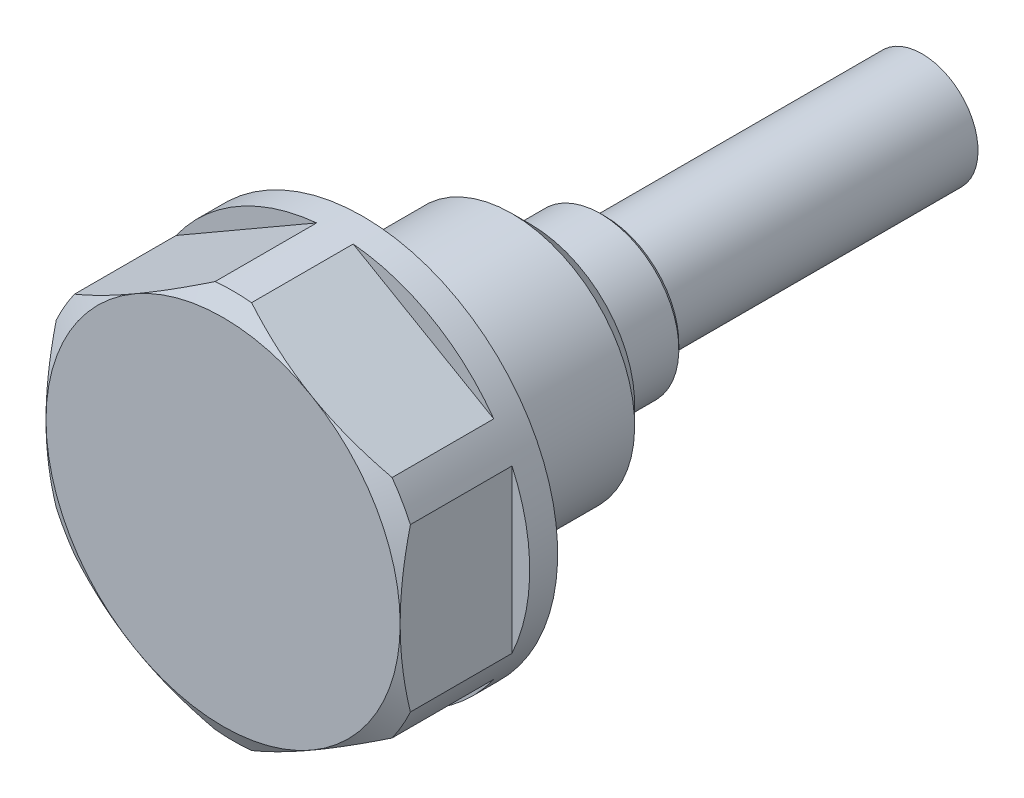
ISO-10303-21;
HEADER;
FILE_DESCRIPTION(('STEP AP214'),'2;1');
FILE_NAME('part.step','',(''),(''),'','','');
FILE_SCHEMA(('AUTOMOTIVE_DESIGN { 1 0 10303 214 1 1 1 1 }'));
ENDSEC;
DATA;
#1=APPLICATION_CONTEXT('core data for automotive mechanical design processes');
#2=APPLICATION_PROTOCOL_DEFINITION('international standard','automotive_design',2000,#1);
#3=PRODUCT_CONTEXT('',#1,'mechanical');
#4=PRODUCT('Part','Part','',(#3));
#5=PRODUCT_RELATED_PRODUCT_CATEGORY('part','',(#4));
#6=PRODUCT_DEFINITION_FORMATION('','',#4);
#7=PRODUCT_DEFINITION_CONTEXT('part definition',#1,'design');
#8=PRODUCT_DEFINITION('design','',#6,#7);
#9=PRODUCT_DEFINITION_SHAPE('','',#8);
#10=(LENGTH_UNIT() NAMED_UNIT(*) SI_UNIT(.MILLI.,.METRE.));
#11=(NAMED_UNIT(*) PLANE_ANGLE_UNIT() SI_UNIT($,.RADIAN.));
#12=(NAMED_UNIT(*) SI_UNIT($,.STERADIAN.) SOLID_ANGLE_UNIT());
#13=UNCERTAINTY_MEASURE_WITH_UNIT(LENGTH_MEASURE(1.E-05),#10,'distance_accuracy_value','');
#14=(GEOMETRIC_REPRESENTATION_CONTEXT(3) GLOBAL_UNCERTAINTY_ASSIGNED_CONTEXT((#13)) GLOBAL_UNIT_ASSIGNED_CONTEXT((#10,
#11,#12)) REPRESENTATION_CONTEXT('',''));
#15=CARTESIAN_POINT('',(0.,0.,0.));
#16=DIRECTION('',(0.,0.,1.));
#17=DIRECTION('',(1.,0.,0.));
#18=AXIS2_PLACEMENT_3D('',#15,#16,#17);
#19=CARTESIAN_POINT('',(0.,0.,8.));
#20=DIRECTION('',(0.,0.,-1.));
#21=DIRECTION('',(0.,1.,0.));
#22=AXIS2_PLACEMENT_3D('',#19,#20,#21);
#23=CONICAL_SURFACE('',#22,9.5,1.0471975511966);
#24=CARTESIAN_POINT('',(0.,0.,7.45151724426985));
#25=DIRECTION('',(0.,0.,-1.));
#26=DIRECTION('',(0.,1.,0.));
#27=AXIS2_PLACEMENT_3D('',#24,#25,#26);
#28=CIRCLE('',#27,10.45);
#29=CARTESIAN_POINT('',(0.979804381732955,-10.4039647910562,7.45151724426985));
#30=VERTEX_POINT('',#29);
#31=CARTESIAN_POINT('',(-0.979804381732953,-10.4039647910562,7.45151724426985));
#32=VERTEX_POINT('',#31);
#33=EDGE_CURVE('E188',#30,#32,#28,.T.);
#34=ORIENTED_EDGE('',*,*,#33,.F.);
#35=CARTESIAN_POINT('',(0.979084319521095,-10.404380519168,7.45131724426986));
#36=CARTESIAN_POINT('',(1.18035340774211,-10.2881777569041,7.50723052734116));
#37=CARTESIAN_POINT('',(1.38237568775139,-10.1715401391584,7.5596440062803));
#38=CARTESIAN_POINT('',(1.78787427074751,-9.9374254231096,7.65669979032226));
#39=CARTESIAN_POINT('',(1.99135098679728,-9.81994808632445,7.70133978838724));
#40=CARTESIAN_POINT('',(2.39982016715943,-9.58411829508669,7.78208913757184));
#41=CARTESIAN_POINT('',(2.60481409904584,-9.46576499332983,7.81818867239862));
#42=CARTESIAN_POINT('',(3.01585684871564,-9.22844935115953,7.88106875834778));
#43=CARTESIAN_POINT('',(3.22190555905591,-9.1094870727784,7.90785024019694));
#44=CARTESIAN_POINT('',(3.63076754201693,-8.87343049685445,7.95108285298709));
#45=CARTESIAN_POINT('',(3.83356555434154,-8.75634500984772,7.96772524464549));
#46=CARTESIAN_POINT('',(4.23958832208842,-8.52192765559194,7.99110913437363));
#47=CARTESIAN_POINT('',(4.4428130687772,-8.40459579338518,7.99785083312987));
#48=CARTESIAN_POINT('',(4.84917698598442,-8.16998147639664,8.00127268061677));
#49=CARTESIAN_POINT('',(5.05231610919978,-8.05269904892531,7.99796024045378));
#50=CARTESIAN_POINT('',(5.45827120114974,-7.8183207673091,7.98137010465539));
#51=CARTESIAN_POINT('',(5.66108719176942,-7.70122490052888,7.96809311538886));
#52=CARTESIAN_POINT('',(6.08626864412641,-7.45574627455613,7.9300729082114));
#53=CARTESIAN_POINT('',(6.30856621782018,-7.32740271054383,7.90431807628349));
#54=CARTESIAN_POINT('',(6.75200827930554,-7.07138131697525,7.84179648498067));
#55=CARTESIAN_POINT('',(6.9731526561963,-6.9437035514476,7.80502868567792));
#56=CARTESIAN_POINT('',(7.41643130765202,-6.68777650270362,7.72088916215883));
#57=CARTESIAN_POINT('',(7.63854931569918,-6.55953661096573,7.67340424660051));
#58=CARTESIAN_POINT('',(8.08105043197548,-6.3040584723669,7.56910437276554));
#59=CARTESIAN_POINT('',(8.30143418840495,-6.17681985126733,7.51229309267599));
#60=CARTESIAN_POINT('',(8.5209156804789,-6.05010215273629,7.45131724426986));
#61=B_SPLINE_CURVE_WITH_KNOTS('',3,(#35,#36,#37,#38,#39,#40,#41,#42,#43,#44,#45,#46,#47,#48,#49,
#50,#51,#52,#53,#54,#55,#56,#57,#58,#59,#60),.UNSPECIFIED.,.F.,.F.,(4,2,2,2,2,2,2,2,2,2,2,2,4),
(0.,0.717123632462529,1.43445973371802,2.15261636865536,2.87070125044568,3.57478328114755,
4.27885103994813,4.98239994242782,5.68589897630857,6.45956921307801,7.23331252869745,
8.01564581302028,8.79767129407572),.UNSPECIFIED.);
#62=CARTESIAN_POINT('',(4.75,-8.22724133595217,8.));
#63=VERTEX_POINT('',#62);
#64=EDGE_CURVE('E291',#30,#63,#61,.T.);
#65=ORIENTED_EDGE('',*,*,#64,.T.);
#66=CARTESIAN_POINT('',(0.,0.,8.));
#67=DIRECTION('',(0.,0.,-1.));
#68=DIRECTION('',(0.,1.,0.));
#69=AXIS2_PLACEMENT_3D('',#66,#67,#68);
#70=CIRCLE('',#69,9.5);
#71=CARTESIAN_POINT('',(-4.75,-8.22724133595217,8.));
#72=VERTEX_POINT('',#71);
#73=EDGE_CURVE('E170',#63,#72,#70,.T.);
#74=ORIENTED_EDGE('',*,*,#73,.T.);
#75=CARTESIAN_POINT('',(-8.5209156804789,-6.05010215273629,7.45131724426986));
#76=CARTESIAN_POINT('',(-8.31964659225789,-6.16630491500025,7.50723052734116));
#77=CARTESIAN_POINT('',(-8.11762431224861,-6.28294253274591,7.5596440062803));
#78=CARTESIAN_POINT('',(-7.71212572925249,-6.51705724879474,7.65669979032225));
#79=CARTESIAN_POINT('',(-7.50864901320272,-6.63453458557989,7.70133978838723));
#80=CARTESIAN_POINT('',(-7.10017983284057,-6.87036437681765,7.78208913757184));
#81=CARTESIAN_POINT('',(-6.89518590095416,-6.9887176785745,7.81818867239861));
#82=CARTESIAN_POINT('',(-6.48414315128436,-7.22603332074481,7.88106875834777));
#83=CARTESIAN_POINT('',(-6.27809444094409,-7.34499559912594,7.90785024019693));
#84=CARTESIAN_POINT('',(-5.86923245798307,-7.58105217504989,7.95108285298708));
#85=CARTESIAN_POINT('',(-5.66643444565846,-7.69813766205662,7.96772524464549));
#86=CARTESIAN_POINT('',(-5.26041167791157,-7.9325550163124,7.99110913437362));
#87=CARTESIAN_POINT('',(-5.0571869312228,-8.04988687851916,7.99785083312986));
#88=CARTESIAN_POINT('',(-4.65082301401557,-8.2845011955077,8.00127268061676));
#89=CARTESIAN_POINT('',(-4.44768389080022,-8.40178362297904,7.99796024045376));
#90=CARTESIAN_POINT('',(-4.04172879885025,-8.63616190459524,7.98137010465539));
#91=CARTESIAN_POINT('',(-3.83891280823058,-8.75325777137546,7.96809311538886));
#92=CARTESIAN_POINT('',(-3.41373135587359,-8.99873639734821,7.9300729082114));
#93=CARTESIAN_POINT('',(-3.19143378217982,-9.12707996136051,7.90431807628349));
#94=CARTESIAN_POINT('',(-2.74799172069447,-9.38310135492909,7.84179648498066));
#95=CARTESIAN_POINT('',(-2.5268473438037,-9.51077912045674,7.80502868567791));
#96=CARTESIAN_POINT('',(-2.08356869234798,-9.76670616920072,7.72088916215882));
#97=CARTESIAN_POINT('',(-1.86145068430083,-9.89494606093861,7.6734042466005));
#98=CARTESIAN_POINT('',(-1.41894956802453,-10.1504241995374,7.56910437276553));
#99=CARTESIAN_POINT('',(-1.19856581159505,-10.277662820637,7.51229309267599));
#100=CARTESIAN_POINT('',(-0.979084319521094,-10.404380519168,7.45131724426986));
#101=B_SPLINE_CURVE_WITH_KNOTS('',3,(#75,#76,#77,#78,#79,#80,#81,#82,#83,#84,#85,#86,#87,#88,
#89,#90,#91,#92,#93,#94,#95,#96,#97,#98,#99,#100),.UNSPECIFIED.,.F.,.F.,(4,2,2,2,2,2,2,2,2,2,2,
2,4),(0.,0.717123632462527,1.43445973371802,2.15261636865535,2.87070125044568,3.57478328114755,
4.27885103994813,4.98239994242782,5.68589897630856,6.459569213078,7.23331252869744,
8.01564581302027,8.79767129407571),.UNSPECIFIED.);
#102=EDGE_CURVE('E193',#72,#32,#101,.T.);
#103=ORIENTED_EDGE('',*,*,#102,.T.);
#104=EDGE_LOOP('',(#34,#65,#74,#103));
#105=FACE_BOUND('',#104,.T.);
#106=ADVANCED_FACE('F14',(#105),#23,.T.);
#107=CARTESIAN_POINT('',(4.75,8.22724133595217,8.));
#108=VERTEX_POINT('',#107);
#109=CARTESIAN_POINT('',(9.5,0.,8.));
#110=VERTEX_POINT('',#109);
#111=EDGE_CURVE('E171',#108,#110,#70,.T.);
#112=ORIENTED_EDGE('',*,*,#111,.T.);
#113=CARTESIAN_POINT('',(9.5,14.5049986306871,3.47408357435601));
#114=CARTESIAN_POINT('',(9.5,14.2966155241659,3.57472653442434));
#115=CARTESIAN_POINT('',(9.5,14.0879793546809,3.67484526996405));
#116=CARTESIAN_POINT('',(9.5,13.6701474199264,3.87391386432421));
#117=CARTESIAN_POINT('',(9.5,13.4609516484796,3.97286371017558));
#118=CARTESIAN_POINT('',(9.5,12.8323827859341,4.26780825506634));
#119=CARTESIAN_POINT('',(9.5,12.4120966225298,4.46186479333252));
#120=CARTESIAN_POINT('',(9.5,11.566179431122,4.84466753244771));
#121=CARTESIAN_POINT('',(9.5,11.1405315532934,5.03337659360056));
#122=CARTESIAN_POINT('',(9.5,10.2857226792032,5.40263231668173));
#123=CARTESIAN_POINT('',(9.5,9.85656186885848,5.58317940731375));
#124=CARTESIAN_POINT('',(9.5,8.98890973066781,5.93599798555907));
#125=CARTESIAN_POINT('',(9.5,8.55036807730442,6.10814639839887));
#126=CARTESIAN_POINT('',(9.5,7.6680986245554,6.43885683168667));
#127=CARTESIAN_POINT('',(9.5,7.2243702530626,6.59741733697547));
#128=CARTESIAN_POINT('',(9.5,6.33194121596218,6.89666011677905));
#129=CARTESIAN_POINT('',(9.5,5.88325356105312,7.03738076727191));
#130=CARTESIAN_POINT('',(9.5,4.97951775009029,7.29634936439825));
#131=CARTESIAN_POINT('',(9.5,4.5244716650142,7.41460445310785));
#132=CARTESIAN_POINT('',(9.5,3.60761543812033,7.6228695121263));
#133=CARTESIAN_POINT('',(9.5,3.1458030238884,7.71286975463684));
#134=CARTESIAN_POINT('',(9.5,2.44905660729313,7.82214872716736));
#135=CARTESIAN_POINT('',(9.5,2.21610795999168,7.85429049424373));
#136=CARTESIAN_POINT('',(9.5,1.74913216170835,7.90936727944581));
#137=CARTESIAN_POINT('',(9.5,1.51510511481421,7.9323031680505));
#138=CARTESIAN_POINT('',(9.5,1.04775047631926,7.96835279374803));
#139=CARTESIAN_POINT('',(9.5,0.814427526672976,7.98152647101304));
#140=CARTESIAN_POINT('',(9.5,0.347433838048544,7.99798272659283));
#141=CARTESIAN_POINT('',(9.5,0.113763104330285,8.00126545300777));
#142=CARTESIAN_POINT('',(9.5,-0.353441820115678,7.99786178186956));
#143=CARTESIAN_POINT('',(9.5,-0.586976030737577,7.99117814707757));
#144=CARTESIAN_POINT('',(9.5,-1.05356083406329,7.9680067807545));
#145=CARTESIAN_POINT('',(9.5,-1.28661139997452,7.95151851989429));
#146=CARTESIAN_POINT('',(9.5,-1.85262325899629,7.89990889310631));
#147=CARTESIAN_POINT('',(9.5,-2.18513944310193,7.8598102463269));
#148=CARTESIAN_POINT('',(9.5,-2.84753886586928,7.7618957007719));
#149=CARTESIAN_POINT('',(9.5,-3.17742170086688,7.70407713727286));
#150=CARTESIAN_POINT('',(9.5,-4.16370952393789,7.50694458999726));
#151=CARTESIAN_POINT('',(9.5,-4.81546168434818,7.34408649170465));
#152=CARTESIAN_POINT('',(9.5,-5.79029236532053,7.0636221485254));
#153=CARTESIAN_POINT('',(9.5,-6.11847294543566,6.96274618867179));
#154=CARTESIAN_POINT('',(9.5,-6.77166374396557,6.75102188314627));
#155=CARTESIAN_POINT('',(9.5,-7.09667367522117,6.64017264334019));
#156=CARTESIAN_POINT('',(9.5,-7.74190014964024,6.41087055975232));
#157=CARTESIAN_POINT('',(9.5,-8.06213340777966,6.29246427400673));
#158=CARTESIAN_POINT('',(9.5,-8.69988055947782,6.04884949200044));
#159=CARTESIAN_POINT('',(9.5,-9.01739535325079,5.92364335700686));
#160=CARTESIAN_POINT('',(9.5,-9.33376649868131,5.79567508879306));
#161=B_SPLINE_CURVE_WITH_KNOTS('',3,(#113,#114,#115,#116,#117,#118,#119,#120,#121,#122,#123,
#124,#125,#126,#127,#128,#129,#130,#131,#132,#133,#134,#135,#136,#137,#138,#139,#140,#141,#142,
#143,#144,#145,#146,#147,#148,#149,#150,#151,#152,#153,#154,#155,#156,#157,#158,#159,#160),
.UNSPECIFIED.,.F.,.F.,(4,2,2,2,2,2,2,2,2,2,2,2,2,2,2,2,2,2,2,2,2,2,2,4),(0.,0.694241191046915,
1.38849007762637,2.77721609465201,4.17396211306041,5.57063468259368,6.98381953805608,
8.39716177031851,9.8074101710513,11.2172094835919,12.6274936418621,13.332807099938,
14.0380538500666,14.7389336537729,15.4398029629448,16.140478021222,16.8411909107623,
17.8453952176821,18.84975061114,20.8623409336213,21.8922649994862,22.9222814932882,
23.9464715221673,24.9703081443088),.UNSPECIFIED.);
#162=CARTESIAN_POINT('',(9.5,4.35344691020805,7.45151724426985));
#163=VERTEX_POINT('',#162);
#164=EDGE_CURVE('E278',#110,#163,#161,.F.);
#165=ORIENTED_EDGE('',*,*,#164,.T.);
#166=CARTESIAN_POINT('',(8.52019561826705,6.05051788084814,7.45151724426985));
#167=VERTEX_POINT('',#166);
#168=EDGE_CURVE('E347',#167,#163,#28,.T.);
#169=ORIENTED_EDGE('',*,*,#168,.F.);
#170=CARTESIAN_POINT('',(8.5209156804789,6.05010215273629,7.45131724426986));
#171=CARTESIAN_POINT('',(8.31964659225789,6.16630491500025,7.50723052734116));
#172=CARTESIAN_POINT('',(8.11762431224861,6.28294253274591,7.5596440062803));
#173=CARTESIAN_POINT('',(7.71212572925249,6.51705724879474,7.65669979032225));
#174=CARTESIAN_POINT('',(7.50864901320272,6.63453458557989,7.70133978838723));
#175=CARTESIAN_POINT('',(7.10017983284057,6.87036437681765,7.78208913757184));
#176=CARTESIAN_POINT('',(6.89518590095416,6.9887176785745,7.81818867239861));
#177=CARTESIAN_POINT('',(6.48414315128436,7.22603332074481,7.88106875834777));
#178=CARTESIAN_POINT('',(6.27809444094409,7.34499559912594,7.90785024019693));
#179=CARTESIAN_POINT('',(5.86923245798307,7.58105217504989,7.95108285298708));
#180=CARTESIAN_POINT('',(5.66643444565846,7.69813766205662,7.96772524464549));
#181=CARTESIAN_POINT('',(5.26041167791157,7.9325550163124,7.99110913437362));
#182=CARTESIAN_POINT('',(5.0571869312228,8.04988687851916,7.99785083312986));
#183=CARTESIAN_POINT('',(4.65082301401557,8.2845011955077,8.00127268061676));
#184=CARTESIAN_POINT('',(4.44768389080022,8.40178362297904,7.99796024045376));
#185=CARTESIAN_POINT('',(4.04172879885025,8.63616190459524,7.98137010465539));
#186=CARTESIAN_POINT('',(3.83891280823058,8.75325777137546,7.96809311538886));
#187=CARTESIAN_POINT('',(3.41373135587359,8.99873639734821,7.9300729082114));
#188=CARTESIAN_POINT('',(3.19143378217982,9.12707996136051,7.90431807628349));
#189=CARTESIAN_POINT('',(2.74799172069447,9.38310135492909,7.84179648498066));
#190=CARTESIAN_POINT('',(2.5268473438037,9.51077912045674,7.80502868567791));
#191=CARTESIAN_POINT('',(2.08356869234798,9.76670616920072,7.72088916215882));
#192=CARTESIAN_POINT('',(1.86145068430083,9.89494606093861,7.6734042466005));
#193=CARTESIAN_POINT('',(1.41894956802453,10.1504241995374,7.56910437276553));
#194=CARTESIAN_POINT('',(1.19856581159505,10.277662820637,7.51229309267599));
#195=CARTESIAN_POINT('',(0.979084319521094,10.404380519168,7.45131724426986));
#196=B_SPLINE_CURVE_WITH_KNOTS('',3,(#170,#171,#172,#173,#174,#175,#176,#177,#178,#179,#180,
#181,#182,#183,#184,#185,#186,#187,#188,#189,#190,#191,#192,#193,#194,#195),.UNSPECIFIED.,.F.,
.F.,(4,2,2,2,2,2,2,2,2,2,2,2,4),(0.,0.717123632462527,1.43445973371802,2.15261636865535,
2.87070125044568,3.57478328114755,4.27885103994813,4.98239994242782,5.68589897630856,
6.459569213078,7.23331252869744,8.01564581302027,8.79767129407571),.UNSPECIFIED.);
#197=EDGE_CURVE('E279',#167,#108,#196,.T.);
#198=ORIENTED_EDGE('',*,*,#197,.T.);
#199=EDGE_LOOP('',(#112,#165,#169,#198));
#200=FACE_BOUND('',#199,.T.);
#201=ADVANCED_FACE('F262',(#200),#23,.T.);
#202=CARTESIAN_POINT('',(-4.75,8.22724133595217,8.));
#203=VERTEX_POINT('',#202);
#204=EDGE_CURVE('E283',#203,#108,#70,.T.);
#205=ORIENTED_EDGE('',*,*,#204,.T.);
#206=CARTESIAN_POINT('',(0.979804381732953,10.4039647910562,7.45151724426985));
#207=VERTEX_POINT('',#206);
#208=EDGE_CURVE('E289',#108,#207,#196,.T.);
#209=ORIENTED_EDGE('',*,*,#208,.T.);
#210=CARTESIAN_POINT('',(-0.979804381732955,10.4039647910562,7.45151724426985));
#211=VERTEX_POINT('',#210);
#212=EDGE_CURVE('E346',#211,#207,#28,.T.);
#213=ORIENTED_EDGE('',*,*,#212,.F.);
#214=CARTESIAN_POINT('',(-0.979084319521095,10.404380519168,7.45131724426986));
#215=CARTESIAN_POINT('',(-1.18035340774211,10.2881777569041,7.50723052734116));
#216=CARTESIAN_POINT('',(-1.38237568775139,10.1715401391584,7.5596440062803));
#217=CARTESIAN_POINT('',(-1.78787427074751,9.9374254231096,7.65669979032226));
#218=CARTESIAN_POINT('',(-1.99135098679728,9.81994808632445,7.70133978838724));
#219=CARTESIAN_POINT('',(-2.39982016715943,9.58411829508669,7.78208913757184));
#220=CARTESIAN_POINT('',(-2.60481409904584,9.46576499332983,7.81818867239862));
#221=CARTESIAN_POINT('',(-3.01585684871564,9.22844935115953,7.88106875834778));
#222=CARTESIAN_POINT('',(-3.22190555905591,9.1094870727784,7.90785024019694));
#223=CARTESIAN_POINT('',(-3.63076754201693,8.87343049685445,7.95108285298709));
#224=CARTESIAN_POINT('',(-3.83356555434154,8.75634500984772,7.96772524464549));
#225=CARTESIAN_POINT('',(-4.23958832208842,8.52192765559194,7.99110913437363));
#226=CARTESIAN_POINT('',(-4.4428130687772,8.40459579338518,7.99785083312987));
#227=CARTESIAN_POINT('',(-4.84917698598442,8.16998147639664,8.00127268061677));
#228=CARTESIAN_POINT('',(-5.05231610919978,8.05269904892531,7.99796024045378));
#229=CARTESIAN_POINT('',(-5.45827120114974,7.8183207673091,7.98137010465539));
#230=CARTESIAN_POINT('',(-5.66108719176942,7.70122490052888,7.96809311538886));
#231=CARTESIAN_POINT('',(-6.08626864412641,7.45574627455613,7.9300729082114));
#232=CARTESIAN_POINT('',(-6.30856621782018,7.32740271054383,7.90431807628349));
#233=CARTESIAN_POINT('',(-6.75200827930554,7.07138131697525,7.84179648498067));
#234=CARTESIAN_POINT('',(-6.9731526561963,6.9437035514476,7.80502868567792));
#235=CARTESIAN_POINT('',(-7.41643130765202,6.68777650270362,7.72088916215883));
#236=CARTESIAN_POINT('',(-7.63854931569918,6.55953661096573,7.67340424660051));
#237=CARTESIAN_POINT('',(-8.08105043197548,6.3040584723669,7.56910437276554));
#238=CARTESIAN_POINT('',(-8.30143418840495,6.17681985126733,7.51229309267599));
#239=CARTESIAN_POINT('',(-8.5209156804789,6.05010215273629,7.45131724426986));
#240=B_SPLINE_CURVE_WITH_KNOTS('',3,(#214,#215,#216,#217,#218,#219,#220,#221,#222,#223,#224,
#225,#226,#227,#228,#229,#230,#231,#232,#233,#234,#235,#236,#237,#238,#239),.UNSPECIFIED.,.F.,
.F.,(4,2,2,2,2,2,2,2,2,2,2,2,4),(0.,0.717123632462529,1.43445973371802,2.15261636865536,
2.87070125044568,3.57478328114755,4.27885103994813,4.98239994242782,5.68589897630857,
6.45956921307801,7.23331252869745,8.01564581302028,8.79767129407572),.UNSPECIFIED.);
#241=EDGE_CURVE('E327',#211,#203,#240,.T.);
#242=ORIENTED_EDGE('',*,*,#241,.T.);
#243=EDGE_LOOP('',(#205,#209,#213,#242));
#244=FACE_BOUND('',#243,.T.);
#245=ADVANCED_FACE('F266',(#244),#23,.T.);
#246=CARTESIAN_POINT('',(-9.5,0.,8.));
#247=VERTEX_POINT('',#246);
#248=EDGE_CURVE('E459',#247,#203,#70,.T.);
#249=ORIENTED_EDGE('',*,*,#248,.T.);
#250=CARTESIAN_POINT('',(-8.52019561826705,6.05051788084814,7.45151724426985));
#251=VERTEX_POINT('',#250);
#252=EDGE_CURVE('E333',#203,#251,#240,.T.);
#253=ORIENTED_EDGE('',*,*,#252,.T.);
#254=CARTESIAN_POINT('',(-9.5,4.35344691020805,7.45151724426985));
#255=VERTEX_POINT('',#254);
#256=EDGE_CURVE('E343',#255,#251,#28,.T.);
#257=ORIENTED_EDGE('',*,*,#256,.F.);
#258=CARTESIAN_POINT('',(-9.5,14.5049986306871,3.474083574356));
#259=CARTESIAN_POINT('',(-9.5,14.2966155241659,3.57472653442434));
#260=CARTESIAN_POINT('',(-9.5,14.0879793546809,3.67484526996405));
#261=CARTESIAN_POINT('',(-9.5,13.6701474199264,3.87391386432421));
#262=CARTESIAN_POINT('',(-9.5,13.4609516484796,3.97286371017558));
#263=CARTESIAN_POINT('',(-9.5,12.8323827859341,4.26780825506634));
#264=CARTESIAN_POINT('',(-9.5,12.4120966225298,4.46186479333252));
#265=CARTESIAN_POINT('',(-9.5,11.566179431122,4.84466753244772));
#266=CARTESIAN_POINT('',(-9.5,11.1405315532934,5.03337659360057));
#267=CARTESIAN_POINT('',(-9.5,10.2857226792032,5.40263231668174));
#268=CARTESIAN_POINT('',(-9.5,9.85656186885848,5.58317940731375));
#269=CARTESIAN_POINT('',(-9.5,8.98890973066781,5.93599798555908));
#270=CARTESIAN_POINT('',(-9.5,8.55036807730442,6.10814639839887));
#271=CARTESIAN_POINT('',(-9.5,7.6680986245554,6.43885683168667));
#272=CARTESIAN_POINT('',(-9.5,7.2243702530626,6.59741733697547));
#273=CARTESIAN_POINT('',(-9.5,6.33194121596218,6.89666011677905));
#274=CARTESIAN_POINT('',(-9.5,5.88325356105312,7.03738076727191));
#275=CARTESIAN_POINT('',(-9.5,4.97951775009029,7.29634936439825));
#276=CARTESIAN_POINT('',(-9.5,4.5244716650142,7.41460445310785));
#277=CARTESIAN_POINT('',(-9.5,3.60761543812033,7.6228695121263));
#278=CARTESIAN_POINT('',(-9.5,3.1458030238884,7.71286975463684));
#279=CARTESIAN_POINT('',(-9.5,2.44905660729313,7.82214872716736));
#280=CARTESIAN_POINT('',(-9.5,2.21610795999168,7.85429049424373));
#281=CARTESIAN_POINT('',(-9.5,1.74913216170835,7.90936727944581));
#282=CARTESIAN_POINT('',(-9.5,1.51510511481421,7.9323031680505));
#283=CARTESIAN_POINT('',(-9.5,1.04775047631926,7.96835279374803));
#284=CARTESIAN_POINT('',(-9.5,0.814427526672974,7.98152647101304));
#285=CARTESIAN_POINT('',(-9.5,0.347433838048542,7.99798272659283));
#286=CARTESIAN_POINT('',(-9.5,0.113763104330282,8.00126545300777));
#287=CARTESIAN_POINT('',(-9.5,-0.353441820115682,7.99786178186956));
#288=CARTESIAN_POINT('',(-9.5,-0.586976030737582,7.99117814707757));
#289=CARTESIAN_POINT('',(-9.5,-1.0535608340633,7.9680067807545));
#290=CARTESIAN_POINT('',(-9.5,-1.28661139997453,7.95151851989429));
#291=CARTESIAN_POINT('',(-9.5,-1.8526232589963,7.89990889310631));
#292=CARTESIAN_POINT('',(-9.5,-2.18513944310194,7.8598102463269));
#293=CARTESIAN_POINT('',(-9.5,-2.84753886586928,7.7618957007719));
#294=CARTESIAN_POINT('',(-9.5,-3.17742170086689,7.70407713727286));
#295=CARTESIAN_POINT('',(-9.5,-4.1637095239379,7.50694458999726));
#296=CARTESIAN_POINT('',(-9.5,-4.81546168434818,7.34408649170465));
#297=CARTESIAN_POINT('',(-9.5,-5.79029236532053,7.0636221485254));
#298=CARTESIAN_POINT('',(-9.5,-6.11847294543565,6.96274618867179));
#299=CARTESIAN_POINT('',(-9.5,-6.77166374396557,6.75102188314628));
#300=CARTESIAN_POINT('',(-9.5,-7.09667367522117,6.64017264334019));
#301=CARTESIAN_POINT('',(-9.5,-7.74190014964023,6.41087055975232));
#302=CARTESIAN_POINT('',(-9.5,-8.06213340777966,6.29246427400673));
#303=CARTESIAN_POINT('',(-9.5,-8.69988055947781,6.04884949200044));
#304=CARTESIAN_POINT('',(-9.5,-9.01739535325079,5.92364335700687));
#305=CARTESIAN_POINT('',(-9.5,-9.3337664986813,5.79567508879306));
#306=B_SPLINE_CURVE_WITH_KNOTS('',3,(#258,#259,#260,#261,#262,#263,#264,#265,#266,#267,#268,
#269,#270,#271,#272,#273,#274,#275,#276,#277,#278,#279,#280,#281,#282,#283,#284,#285,#286,#287,
#288,#289,#290,#291,#292,#293,#294,#295,#296,#297,#298,#299,#300,#301,#302,#303,#304,#305),
.UNSPECIFIED.,.F.,.F.,(4,2,2,2,2,2,2,2,2,2,2,2,2,2,2,2,2,2,2,2,2,2,2,4),(0.,0.694241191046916,
1.38849007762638,2.77721609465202,4.17396211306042,5.57063468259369,6.98381953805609,
8.39716177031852,9.80741017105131,11.2172094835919,12.6274936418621,13.332807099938,
14.0380538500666,14.7389336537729,15.4398029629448,16.140478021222,16.8411909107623,
17.8453952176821,18.84975061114,20.8623409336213,21.8922649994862,22.9222814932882,
23.9464715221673,24.9703081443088),.UNSPECIFIED.);
#307=EDGE_CURVE('E201',#255,#247,#306,.T.);
#308=ORIENTED_EDGE('',*,*,#307,.T.);
#309=EDGE_LOOP('',(#249,#253,#257,#308));
#310=FACE_BOUND('',#309,.T.);
#311=ADVANCED_FACE('F271',(#310),#23,.T.);
#312=EDGE_CURVE('E341',#72,#247,#70,.T.);
#313=ORIENTED_EDGE('',*,*,#312,.T.);
#314=CARTESIAN_POINT('',(-9.5,-4.35344691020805,7.45151724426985));
#315=VERTEX_POINT('',#314);
#316=EDGE_CURVE('E204',#247,#315,#306,.T.);
#317=ORIENTED_EDGE('',*,*,#316,.T.);
#318=CARTESIAN_POINT('',(-8.52019561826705,-6.05051788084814,7.45151724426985));
#319=VERTEX_POINT('',#318);
#320=EDGE_CURVE('E340',#319,#315,#28,.T.);
#321=ORIENTED_EDGE('',*,*,#320,.F.);
#322=EDGE_CURVE('E137',#319,#72,#101,.T.);
#323=ORIENTED_EDGE('',*,*,#322,.T.);
#324=EDGE_LOOP('',(#313,#317,#321,#323));
#325=FACE_BOUND('',#324,.T.);
#326=ADVANCED_FACE('F259',(#325),#23,.T.);
#327=CARTESIAN_POINT('',(0.,0.,8.));
#328=DIRECTION('',(0.,0.,-1.));
#329=DIRECTION('',(0.,1.,0.));
#330=AXIS2_PLACEMENT_3D('',#327,#328,#329);
#331=PLANE('',#330);
#332=EDGE_CURVE('E164',#110,#63,#70,.T.);
#333=ORIENTED_EDGE('',*,*,#332,.F.);
#334=ORIENTED_EDGE('',*,*,#111,.F.);
#335=ORIENTED_EDGE('',*,*,#204,.F.);
#336=ORIENTED_EDGE('',*,*,#248,.F.);
#337=ORIENTED_EDGE('',*,*,#312,.F.);
#338=ORIENTED_EDGE('',*,*,#73,.F.);
#339=EDGE_LOOP('',(#333,#334,#335,#336,#337,#338));
#340=FACE_BOUND('',#339,.T.);
#341=ADVANCED_FACE('F16',(#340),#331,.F.);
#342=ORIENTED_EDGE('',*,*,#332,.T.);
#343=CARTESIAN_POINT('',(8.52019561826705,-6.05051788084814,7.45151724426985));
#344=VERTEX_POINT('',#343);
#345=EDGE_CURVE('E286',#63,#344,#61,.T.);
#346=ORIENTED_EDGE('',*,*,#345,.T.);
#347=CARTESIAN_POINT('',(9.5,-4.35344691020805,7.45151724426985));
#348=VERTEX_POINT('',#347);
#349=EDGE_CURVE('E144',#348,#344,#28,.T.);
#350=ORIENTED_EDGE('',*,*,#349,.F.);
#351=EDGE_CURVE('E287',#348,#110,#161,.F.);
#352=ORIENTED_EDGE('',*,*,#351,.T.);
#353=EDGE_LOOP('',(#342,#346,#350,#352));
#354=FACE_BOUND('',#353,.T.);
#355=ADVANCED_FACE('F218',(#354),#23,.T.);
#356=CARTESIAN_POINT('',(0.,0.,-29.5));
#357=DIRECTION('',(0.,0.,-1.));
#358=DIRECTION('',(0.,1.,0.));
#359=AXIS2_PLACEMENT_3D('',#356,#357,#358);
#360=CYLINDRICAL_SURFACE('',#359,10.45);
#361=CARTESIAN_POINT('',(0.,0.,0.5));
#362=DIRECTION('',(0.,0.,-1.));
#363=DIRECTION('',(0.,1.,0.));
#364=AXIS2_PLACEMENT_3D('',#361,#362,#363);
#365=CIRCLE('',#364,10.45);
#366=CARTESIAN_POINT('',(0.,10.45,0.5));
#367=VERTEX_POINT('',#366);
#368=EDGE_CURVE('E349',#367,#367,#365,.T.);
#369=ORIENTED_EDGE('',*,*,#368,.F.);
#370=EDGE_LOOP('',(#369));
#371=FACE_BOUND('',#370,.T.);
#372=ORIENTED_EDGE('',*,*,#212,.T.);
#373=DIRECTION('',(0.,0.,-1.));
#374=VECTOR('',#373,1.);
#375=CARTESIAN_POINT('',(0.979804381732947,10.4039647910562,-29.5));
#376=LINE('',#375,#374);
#377=CARTESIAN_POINT('',(0.979804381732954,10.4039647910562,2.));
#378=VERTEX_POINT('',#377);
#379=EDGE_CURVE('E9',#207,#378,#376,.T.);
#380=ORIENTED_EDGE('',*,*,#379,.T.);
#381=CARTESIAN_POINT('',(0.,0.,2.));
#382=DIRECTION('',(0.,0.,-1.));
#383=DIRECTION('',(0.,1.,0.));
#384=AXIS2_PLACEMENT_3D('',#381,#382,#383);
#385=CIRCLE('',#384,10.45);
#386=CARTESIAN_POINT('',(8.52019561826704,6.05051788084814,2.));
#387=VERTEX_POINT('',#386);
#388=EDGE_CURVE('E148',#378,#387,#385,.T.);
#389=ORIENTED_EDGE('',*,*,#388,.T.);
#390=DIRECTION('',(0.,0.,-1.));
#391=VECTOR('',#390,1.);
#392=CARTESIAN_POINT('',(8.52019561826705,6.05051788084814,-29.5));
#393=LINE('',#392,#391);
#394=EDGE_CURVE('E22',#387,#167,#393,.F.);
#395=ORIENTED_EDGE('',*,*,#394,.T.);
#396=ORIENTED_EDGE('',*,*,#168,.T.);
#397=DIRECTION('',(0.,0.,-1.));
#398=VECTOR('',#397,1.);
#399=CARTESIAN_POINT('',(9.5,4.35344691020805,-29.5));
#400=LINE('',#399,#398);
#401=CARTESIAN_POINT('',(9.5,4.35344691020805,2.));
#402=VERTEX_POINT('',#401);
#403=EDGE_CURVE('E153',#163,#402,#400,.T.);
#404=ORIENTED_EDGE('',*,*,#403,.T.);
#405=CARTESIAN_POINT('',(9.5,-4.35344691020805,2.));
#406=VERTEX_POINT('',#405);
#407=EDGE_CURVE('E132',#402,#406,#385,.T.);
#408=ORIENTED_EDGE('',*,*,#407,.T.);
#409=DIRECTION('',(0.,0.,-1.));
#410=VECTOR('',#409,1.);
#411=CARTESIAN_POINT('',(9.5,-4.35344691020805,-29.5));
#412=LINE('',#411,#410);
#413=EDGE_CURVE('E147',#406,#348,#412,.F.);
#414=ORIENTED_EDGE('',*,*,#413,.T.);
#415=ORIENTED_EDGE('',*,*,#349,.T.);
#416=DIRECTION('',(0.,0.,-1.));
#417=VECTOR('',#416,1.);
#418=CARTESIAN_POINT('',(8.52019561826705,-6.05051788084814,-29.5));
#419=LINE('',#418,#417);
#420=CARTESIAN_POINT('',(8.52019561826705,-6.05051788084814,2.));
#421=VERTEX_POINT('',#420);
#422=EDGE_CURVE('E135',#344,#421,#419,.T.);
#423=ORIENTED_EDGE('',*,*,#422,.T.);
#424=CARTESIAN_POINT('',(0.97980438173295,-10.4039647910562,2.));
#425=VERTEX_POINT('',#424);
#426=EDGE_CURVE('E120',#421,#425,#385,.T.);
#427=ORIENTED_EDGE('',*,*,#426,.T.);
#428=DIRECTION('',(0.,0.,-1.));
#429=VECTOR('',#428,1.);
#430=CARTESIAN_POINT('',(0.979804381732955,-10.4039647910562,-29.5));
#431=LINE('',#430,#429);
#432=EDGE_CURVE('E128',#425,#30,#431,.F.);
#433=ORIENTED_EDGE('',*,*,#432,.T.);
#434=ORIENTED_EDGE('',*,*,#33,.T.);
#435=DIRECTION('',(0.,0.,-1.));
#436=VECTOR('',#435,1.);
#437=CARTESIAN_POINT('',(-0.979804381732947,-10.4039647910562,-29.5));
#438=LINE('',#437,#436);
#439=CARTESIAN_POINT('',(-0.979804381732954,-10.4039647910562,2.));
#440=VERTEX_POINT('',#439);
#441=EDGE_CURVE('E129',#32,#440,#438,.T.);
#442=ORIENTED_EDGE('',*,*,#441,.T.);
#443=CARTESIAN_POINT('',(-8.52019561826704,-6.05051788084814,2.));
#444=VERTEX_POINT('',#443);
#445=EDGE_CURVE('E131',#440,#444,#385,.T.);
#446=ORIENTED_EDGE('',*,*,#445,.T.);
#447=DIRECTION('',(0.,0.,-1.));
#448=VECTOR('',#447,1.);
#449=CARTESIAN_POINT('',(-8.52019561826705,-6.05051788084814,-29.5));
#450=LINE('',#449,#448);
#451=EDGE_CURVE('E180',#444,#319,#450,.F.);
#452=ORIENTED_EDGE('',*,*,#451,.T.);
#453=ORIENTED_EDGE('',*,*,#320,.T.);
#454=DIRECTION('',(0.,0.,-1.));
#455=VECTOR('',#454,1.);
#456=CARTESIAN_POINT('',(-9.5,-4.35344691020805,-29.5));
#457=LINE('',#456,#455);
#458=CARTESIAN_POINT('',(-9.5,-4.35344691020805,2.));
#459=VERTEX_POINT('',#458);
#460=EDGE_CURVE('E176',#315,#459,#457,.T.);
#461=ORIENTED_EDGE('',*,*,#460,.T.);
#462=CARTESIAN_POINT('',(-9.5,4.35344691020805,2.));
#463=VERTEX_POINT('',#462);
#464=EDGE_CURVE('E165',#459,#463,#385,.T.);
#465=ORIENTED_EDGE('',*,*,#464,.T.);
#466=DIRECTION('',(0.,0.,-1.));
#467=VECTOR('',#466,1.);
#468=CARTESIAN_POINT('',(-9.5,4.35344691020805,-29.5));
#469=LINE('',#468,#467);
#470=EDGE_CURVE('E173',#463,#255,#469,.F.);
#471=ORIENTED_EDGE('',*,*,#470,.T.);
#472=ORIENTED_EDGE('',*,*,#256,.T.);
#473=DIRECTION('',(0.,0.,-1.));
#474=VECTOR('',#473,1.);
#475=CARTESIAN_POINT('',(-8.52019561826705,6.05051788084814,-29.5));
#476=LINE('',#475,#474);
#477=CARTESIAN_POINT('',(-8.52019561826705,6.05051788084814,2.));
#478=VERTEX_POINT('',#477);
#479=EDGE_CURVE('E168',#251,#478,#476,.T.);
#480=ORIENTED_EDGE('',*,*,#479,.T.);
#481=CARTESIAN_POINT('',(-0.97980438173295,10.4039647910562,2.));
#482=VERTEX_POINT('',#481);
#483=EDGE_CURVE('E159',#478,#482,#385,.T.);
#484=ORIENTED_EDGE('',*,*,#483,.T.);
#485=DIRECTION('',(0.,0.,-1.));
#486=VECTOR('',#485,1.);
#487=CARTESIAN_POINT('',(-0.979804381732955,10.4039647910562,-29.5));
#488=LINE('',#487,#486);
#489=EDGE_CURVE('E163',#482,#211,#488,.F.);
#490=ORIENTED_EDGE('',*,*,#489,.T.);
#491=EDGE_LOOP('',(#372,#380,#389,#395,#396,#404,#408,#414,#415,#423,#427,#433,#434,#442,#446,
#452,#453,#461,#465,#471,#472,#480,#484,#490));
#492=FACE_BOUND('',#491,.T.);
#493=ADVANCED_FACE('F141',(#371,#492),#360,.T.);
#494=CARTESIAN_POINT('',(10.45,0.,0.5));
#495=DIRECTION('',(0.,0.,1.));
#496=DIRECTION('',(0.,-1.,0.));
#497=AXIS2_PLACEMENT_3D('',#494,#495,#496);
#498=PLANE('',#497);
#499=CARTESIAN_POINT('',(0.,0.,0.5));
#500=DIRECTION('',(0.,0.,-1.));
#501=DIRECTION('',(0.,1.,0.));
#502=AXIS2_PLACEMENT_3D('',#499,#500,#501);
#503=CIRCLE('',#502,7.21183333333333);
#504=CARTESIAN_POINT('',(0.,7.21183333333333,0.5));
#505=VERTEX_POINT('',#504);
#506=EDGE_CURVE('E352',#505,#505,#503,.T.);
#507=ORIENTED_EDGE('',*,*,#506,.F.);
#508=EDGE_LOOP('',(#507));
#509=FACE_BOUND('',#508,.T.);
#510=ORIENTED_EDGE('',*,*,#368,.T.);
#511=EDGE_LOOP('',(#510));
#512=FACE_BOUND('',#511,.T.);
#513=ADVANCED_FACE('F248',(#509,#512),#498,.F.);
#514=CARTESIAN_POINT('',(0.,0.,-29.5));
#515=DIRECTION('',(0.,0.,-1.));
#516=DIRECTION('',(0.,1.,0.));
#517=AXIS2_PLACEMENT_3D('',#514,#515,#516);
#518=CYLINDRICAL_SURFACE('',#517,7.21183333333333);
#519=CARTESIAN_POINT('',(0.,0.,0.));
#520=DIRECTION('',(0.,0.,-1.));
#521=DIRECTION('',(0.,1.,0.));
#522=AXIS2_PLACEMENT_3D('',#519,#520,#521);
#523=CIRCLE('',#522,7.21183333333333);
#524=CARTESIAN_POINT('',(0.,7.21183333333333,0.));
#525=VERTEX_POINT('',#524);
#526=EDGE_CURVE('E355',#525,#525,#523,.T.);
#527=ORIENTED_EDGE('',*,*,#526,.F.);
#528=EDGE_LOOP('',(#527));
#529=FACE_BOUND('',#528,.T.);
#530=ORIENTED_EDGE('',*,*,#506,.T.);
#531=EDGE_LOOP('',(#530));
#532=FACE_BOUND('',#531,.T.);
#533=ADVANCED_FACE('F244',(#529,#532),#518,.T.);
#534=CARTESIAN_POINT('',(7.21183333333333,0.,0.));
#535=DIRECTION('',(0.,0.,1.));
#536=DIRECTION('',(0.,-1.,0.));
#537=AXIS2_PLACEMENT_3D('',#534,#535,#536);
#538=PLANE('',#537);
#539=CARTESIAN_POINT('',(0.,0.,0.));
#540=DIRECTION('',(0.,0.,-1.));
#541=DIRECTION('',(0.,1.,0.));
#542=AXIS2_PLACEMENT_3D('',#539,#540,#541);
#543=CIRCLE('',#542,6.5785);
#544=CARTESIAN_POINT('',(0.,6.5785,0.));
#545=VERTEX_POINT('',#544);
#546=EDGE_CURVE('E358',#545,#545,#543,.T.);
#547=ORIENTED_EDGE('',*,*,#546,.F.);
#548=EDGE_LOOP('',(#547));
#549=FACE_BOUND('',#548,.T.);
#550=ORIENTED_EDGE('',*,*,#526,.T.);
#551=EDGE_LOOP('',(#550));
#552=FACE_BOUND('',#551,.T.);
#553=ADVANCED_FACE('F240',(#549,#552),#538,.F.);
#554=CARTESIAN_POINT('',(0.,0.,-29.5));
#555=DIRECTION('',(0.,0.,-1.));
#556=DIRECTION('',(0.,1.,0.));
#557=AXIS2_PLACEMENT_3D('',#554,#555,#556);
#558=CYLINDRICAL_SURFACE('',#557,6.5785);
#559=CARTESIAN_POINT('',(0.,0.,0.5));
#560=DIRECTION('',(0.,0.,-1.));
#561=DIRECTION('',(0.,1.,0.));
#562=AXIS2_PLACEMENT_3D('',#559,#560,#561);
#563=CIRCLE('',#562,6.5785);
#564=CARTESIAN_POINT('',(0.,6.5785,0.5));
#565=VERTEX_POINT('',#564);
#566=EDGE_CURVE('E361',#565,#565,#563,.T.);
#567=ORIENTED_EDGE('',*,*,#566,.F.);
#568=EDGE_LOOP('',(#567));
#569=FACE_BOUND('',#568,.T.);
#570=ORIENTED_EDGE('',*,*,#546,.T.);
#571=EDGE_LOOP('',(#570));
#572=FACE_BOUND('',#571,.T.);
#573=ADVANCED_FACE('F236',(#569,#572),#558,.F.);
#574=CARTESIAN_POINT('',(6.5785,0.,0.5));
#575=DIRECTION('',(0.,0.,1.));
#576=DIRECTION('',(0.,-1.,0.));
#577=AXIS2_PLACEMENT_3D('',#574,#575,#576);
#578=PLANE('',#577);
#579=CARTESIAN_POINT('',(0.,0.,0.5));
#580=DIRECTION('',(0.,0.,-1.));
#581=DIRECTION('',(0.,1.,0.));
#582=AXIS2_PLACEMENT_3D('',#579,#580,#581);
#583=CIRCLE('',#582,5.2628);
#584=CARTESIAN_POINT('',(0.,5.2628,0.5));
#585=VERTEX_POINT('',#584);
#586=EDGE_CURVE('E364',#585,#585,#583,.T.);
#587=ORIENTED_EDGE('',*,*,#586,.F.);
#588=EDGE_LOOP('',(#587));
#589=FACE_BOUND('',#588,.T.);
#590=ORIENTED_EDGE('',*,*,#566,.T.);
#591=EDGE_LOOP('',(#590));
#592=FACE_BOUND('',#591,.T.);
#593=ADVANCED_FACE('F232',(#589,#592),#578,.F.);
#594=CARTESIAN_POINT('',(0.,0.,-29.5));
#595=DIRECTION('',(0.,0.,-1.));
#596=DIRECTION('',(0.,1.,0.));
#597=AXIS2_PLACEMENT_3D('',#594,#595,#596);
#598=CYLINDRICAL_SURFACE('',#597,5.2628);
#599=CARTESIAN_POINT('',(0.,0.,-0.5));
#600=DIRECTION('',(0.,0.,-1.));
#601=DIRECTION('',(0.,1.,0.));
#602=AXIS2_PLACEMENT_3D('',#599,#600,#601);
#603=CIRCLE('',#602,5.2628);
#604=CARTESIAN_POINT('',(0.,5.2628,-0.5));
#605=VERTEX_POINT('',#604);
#606=EDGE_CURVE('E366',#605,#605,#603,.T.);
#607=ORIENTED_EDGE('',*,*,#606,.F.);
#608=EDGE_LOOP('',(#607));
#609=FACE_BOUND('',#608,.T.);
#610=ORIENTED_EDGE('',*,*,#586,.T.);
#611=EDGE_LOOP('',(#610));
#612=FACE_BOUND('',#611,.T.);
#613=ADVANCED_FACE('F228',(#609,#612),#598,.T.);
#614=CARTESIAN_POINT('',(0.,0.,2.));
#615=DIRECTION('',(0.,0.,-1.));
#616=DIRECTION('',(0.,1.,0.));
#617=AXIS2_PLACEMENT_3D('',#614,#615,#616);
#618=PLANE('',#617);
#619=DIRECTION('',(0.866025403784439,0.5,0.));
#620=VECTOR('',#619,1.);
#621=CARTESIAN_POINT('',(-9.5,5.48482755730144,2.));
#622=LINE('',#621,#620);
#623=EDGE_CURVE('E452',#478,#482,#622,.T.);
#624=ORIENTED_EDGE('',*,*,#623,.T.);
#625=ORIENTED_EDGE('',*,*,#483,.F.);
#626=EDGE_LOOP('',(#624,#625));
#627=FACE_BOUND('',#626,.T.);
#628=ADVANCED_FACE('F231',(#627),#618,.F.);
#629=CARTESIAN_POINT('',(-9.5,5.48482755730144,2.));
#630=DIRECTION('',(0.5,-0.866025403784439,0.));
#631=DIRECTION('',(-0.866025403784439,-0.5,0.));
#632=AXIS2_PLACEMENT_3D('',#629,#630,#631);
#633=PLANE('',#632);
#634=ORIENTED_EDGE('',*,*,#252,.F.);
#635=ORIENTED_EDGE('',*,*,#241,.F.);
#636=ORIENTED_EDGE('',*,*,#489,.F.);
#637=ORIENTED_EDGE('',*,*,#623,.F.);
#638=ORIENTED_EDGE('',*,*,#479,.F.);
#639=EDGE_LOOP('',(#634,#635,#636,#637,#638));
#640=FACE_BOUND('',#639,.T.);
#641=ADVANCED_FACE('F322',(#640),#633,.F.);
#642=DIRECTION('',(0.,1.,0.));
#643=VECTOR('',#642,1.);
#644=CARTESIAN_POINT('',(-9.5,-5.48482755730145,2.));
#645=LINE('',#644,#643);
#646=EDGE_CURVE('E450',#459,#463,#645,.T.);
#647=ORIENTED_EDGE('',*,*,#646,.T.);
#648=ORIENTED_EDGE('',*,*,#464,.F.);
#649=EDGE_LOOP('',(#647,#648));
#650=FACE_BOUND('',#649,.T.);
#651=ADVANCED_FACE('F325',(#650),#618,.F.);
#652=CARTESIAN_POINT('',(-9.5,-5.48482755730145,2.));
#653=DIRECTION('',(1.,0.,0.));
#654=DIRECTION('',(0.,-1.,0.));
#655=AXIS2_PLACEMENT_3D('',#652,#653,#654);
#656=PLANE('',#655);
#657=ORIENTED_EDGE('',*,*,#316,.F.);
#658=ORIENTED_EDGE('',*,*,#307,.F.);
#659=ORIENTED_EDGE('',*,*,#470,.F.);
#660=ORIENTED_EDGE('',*,*,#646,.F.);
#661=ORIENTED_EDGE('',*,*,#460,.F.);
#662=EDGE_LOOP('',(#657,#658,#659,#660,#661));
#663=FACE_BOUND('',#662,.T.);
#664=ADVANCED_FACE('F225',(#663),#656,.F.);
#665=DIRECTION('',(-0.866025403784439,0.5,0.));
#666=VECTOR('',#665,1.);
#667=CARTESIAN_POINT('',(0.,-10.9696551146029,2.));
#668=LINE('',#667,#666);
#669=EDGE_CURVE('E196',#440,#444,#668,.T.);
#670=ORIENTED_EDGE('',*,*,#669,.T.);
#671=ORIENTED_EDGE('',*,*,#445,.F.);
#672=EDGE_LOOP('',(#670,#671));
#673=FACE_BOUND('',#672,.T.);
#674=ADVANCED_FACE('F224',(#673),#618,.F.);
#675=CARTESIAN_POINT('',(0.,-10.9696551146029,2.));
#676=DIRECTION('',(0.5,0.866025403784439,0.));
#677=DIRECTION('',(0.866025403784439,-0.5,0.));
#678=AXIS2_PLACEMENT_3D('',#675,#676,#677);
#679=PLANE('',#678);
#680=ORIENTED_EDGE('',*,*,#102,.F.);
#681=ORIENTED_EDGE('',*,*,#322,.F.);
#682=ORIENTED_EDGE('',*,*,#451,.F.);
#683=ORIENTED_EDGE('',*,*,#669,.F.);
#684=ORIENTED_EDGE('',*,*,#441,.F.);
#685=EDGE_LOOP('',(#680,#681,#682,#683,#684));
#686=FACE_BOUND('',#685,.T.);
#687=ADVANCED_FACE('F192',(#686),#679,.F.);
#688=DIRECTION('',(-0.866025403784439,-0.5,0.));
#689=VECTOR('',#688,1.);
#690=CARTESIAN_POINT('',(9.5,-5.48482755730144,2.));
#691=LINE('',#690,#689);
#692=EDGE_CURVE('E123',#421,#425,#691,.T.);
#693=ORIENTED_EDGE('',*,*,#692,.T.);
#694=ORIENTED_EDGE('',*,*,#426,.F.);
#695=EDGE_LOOP('',(#693,#694));
#696=FACE_BOUND('',#695,.T.);
#697=ADVANCED_FACE('F122',(#696),#618,.F.);
#698=CARTESIAN_POINT('',(9.5,-5.48482755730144,2.));
#699=DIRECTION('',(-0.5,0.866025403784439,0.));
#700=DIRECTION('',(0.866025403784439,0.5,0.));
#701=AXIS2_PLACEMENT_3D('',#698,#699,#700);
#702=PLANE('',#701);
#703=ORIENTED_EDGE('',*,*,#345,.F.);
#704=ORIENTED_EDGE('',*,*,#64,.F.);
#705=ORIENTED_EDGE('',*,*,#432,.F.);
#706=ORIENTED_EDGE('',*,*,#692,.F.);
#707=ORIENTED_EDGE('',*,*,#422,.F.);
#708=EDGE_LOOP('',(#703,#704,#705,#706,#707));
#709=FACE_BOUND('',#708,.T.);
#710=ADVANCED_FACE('F134',(#709),#702,.F.);
#711=DIRECTION('',(0.,-1.,0.));
#712=VECTOR('',#711,1.);
#713=CARTESIAN_POINT('',(9.5,5.48482755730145,2.));
#714=LINE('',#713,#712);
#715=EDGE_CURVE('E35',#402,#406,#714,.T.);
#716=ORIENTED_EDGE('',*,*,#715,.T.);
#717=ORIENTED_EDGE('',*,*,#407,.F.);
#718=EDGE_LOOP('',(#716,#717));
#719=FACE_BOUND('',#718,.T.);
#720=ADVANCED_FACE('F315',(#719),#618,.F.);
#721=CARTESIAN_POINT('',(9.5,5.48482755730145,2.));
#722=DIRECTION('',(-1.,0.,0.));
#723=DIRECTION('',(0.,1.,0.));
#724=AXIS2_PLACEMENT_3D('',#721,#722,#723);
#725=PLANE('',#724);
#726=ORIENTED_EDGE('',*,*,#164,.F.);
#727=ORIENTED_EDGE('',*,*,#351,.F.);
#728=ORIENTED_EDGE('',*,*,#413,.F.);
#729=ORIENTED_EDGE('',*,*,#715,.F.);
#730=ORIENTED_EDGE('',*,*,#403,.F.);
#731=EDGE_LOOP('',(#726,#727,#728,#729,#730));
#732=FACE_BOUND('',#731,.T.);
#733=ADVANCED_FACE('F311',(#732),#725,.F.);
#734=CARTESIAN_POINT('',(0.,10.9696551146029,2.));
#735=DIRECTION('',(-0.5,-0.866025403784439,0.));
#736=DIRECTION('',(-0.866025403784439,0.5,0.));
#737=AXIS2_PLACEMENT_3D('',#734,#735,#736);
#738=PLANE('',#737);
#739=ORIENTED_EDGE('',*,*,#208,.F.);
#740=ORIENTED_EDGE('',*,*,#197,.F.);
#741=ORIENTED_EDGE('',*,*,#394,.F.);
#742=DIRECTION('',(0.866025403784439,-0.5,0.));
#743=VECTOR('',#742,1.);
#744=CARTESIAN_POINT('',(0.,10.9696551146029,2.));
#745=LINE('',#744,#743);
#746=EDGE_CURVE('E28',#378,#387,#745,.T.);
#747=ORIENTED_EDGE('',*,*,#746,.F.);
#748=ORIENTED_EDGE('',*,*,#379,.F.);
#749=EDGE_LOOP('',(#739,#740,#741,#747,#748));
#750=FACE_BOUND('',#749,.T.);
#751=ADVANCED_FACE('F314',(#750),#738,.F.);
#752=ORIENTED_EDGE('',*,*,#746,.T.);
#753=ORIENTED_EDGE('',*,*,#388,.F.);
#754=EDGE_LOOP('',(#752,#753));
#755=FACE_BOUND('',#754,.T.);
#756=ADVANCED_FACE('F320',(#755),#618,.F.);
#757=CARTESIAN_POINT('',(0.,0.,-0.5));
#758=DIRECTION('',(0.,0.,-1.));
#759=DIRECTION('',(0.,1.,0.));
#760=AXIS2_PLACEMENT_3D('',#757,#758,#759);
#761=PLANE('',#760);
#762=CARTESIAN_POINT('',(0.,0.,-0.5));
#763=DIRECTION('',(0.,0.,-1.));
#764=DIRECTION('',(0.,1.,0.));
#765=AXIS2_PLACEMENT_3D('',#762,#763,#764);
#766=CIRCLE('',#765,6.5785);
#767=CARTESIAN_POINT('',(0.,6.5785,-0.5));
#768=VERTEX_POINT('',#767);
#769=EDGE_CURVE('E446',#768,#768,#766,.T.);
#770=ORIENTED_EDGE('',*,*,#769,.F.);
#771=EDGE_LOOP('',(#770));
#772=FACE_BOUND('',#771,.T.);
#773=ORIENTED_EDGE('',*,*,#606,.T.);
#774=EDGE_LOOP('',(#773));
#775=FACE_BOUND('',#774,.T.);
#776=ADVANCED_FACE('F370',(#772,#775),#761,.F.);
#777=CARTESIAN_POINT('',(0.,0.,-29.5));
#778=DIRECTION('',(0.,0.,-1.));
#779=DIRECTION('',(0.,1.,0.));
#780=AXIS2_PLACEMENT_3D('',#777,#778,#779);
#781=CYLINDRICAL_SURFACE('',#780,6.5785);
#782=CARTESIAN_POINT('',(0.,0.,-7.5));
#783=DIRECTION('',(0.,0.,-1.));
#784=DIRECTION('',(0.,1.,0.));
#785=AXIS2_PLACEMENT_3D('',#782,#783,#784);
#786=CIRCLE('',#785,6.5785);
#787=CARTESIAN_POINT('',(0.,6.5785,-7.5));
#788=VERTEX_POINT('',#787);
#789=EDGE_CURVE('E443',#788,#788,#786,.T.);
#790=ORIENTED_EDGE('',*,*,#789,.F.);
#791=EDGE_LOOP('',(#790));
#792=FACE_BOUND('',#791,.T.);
#793=ORIENTED_EDGE('',*,*,#769,.T.);
#794=EDGE_LOOP('',(#793));
#795=FACE_BOUND('',#794,.T.);
#796=ADVANCED_FACE('F383',(#792,#795),#781,.T.);
#797=CARTESIAN_POINT('',(0.,0.,-7.5));
#798=DIRECTION('',(0.,0.,1.));
#799=DIRECTION('',(0.,-1.,0.));
#800=AXIS2_PLACEMENT_3D('',#797,#798,#799);
#801=CONICAL_SURFACE('',#800,6.5785,0.785398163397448);
#802=CARTESIAN_POINT('',(0.,0.,-8.5));
#803=DIRECTION('',(0.,0.,-1.));
#804=DIRECTION('',(0.,1.,0.));
#805=AXIS2_PLACEMENT_3D('',#802,#803,#804);
#806=CIRCLE('',#805,5.5785);
#807=CARTESIAN_POINT('',(0.,5.5785,-8.5));
#808=VERTEX_POINT('',#807);
#809=EDGE_CURVE('E440',#808,#808,#806,.T.);
#810=ORIENTED_EDGE('',*,*,#809,.F.);
#811=EDGE_LOOP('',(#810));
#812=FACE_BOUND('',#811,.T.);
#813=ORIENTED_EDGE('',*,*,#789,.T.);
#814=EDGE_LOOP('',(#813));
#815=FACE_BOUND('',#814,.T.);
#816=ADVANCED_FACE('F390',(#812,#815),#801,.T.);
#817=CARTESIAN_POINT('',(5.5785,0.,-8.5));
#818=DIRECTION('',(0.,0.,1.));
#819=DIRECTION('',(0.,-1.,0.));
#820=AXIS2_PLACEMENT_3D('',#817,#818,#819);
#821=PLANE('',#820);
#822=CARTESIAN_POINT('',(0.,0.,-8.5));
#823=DIRECTION('',(0.,0.,-1.));
#824=DIRECTION('',(0.,1.,0.));
#825=AXIS2_PLACEMENT_3D('',#822,#823,#824);
#826=CIRCLE('',#825,4.2);
#827=CARTESIAN_POINT('',(0.,4.2,-8.5));
#828=VERTEX_POINT('',#827);
#829=EDGE_CURVE('E437',#828,#828,#826,.T.);
#830=ORIENTED_EDGE('',*,*,#829,.F.);
#831=EDGE_LOOP('',(#830));
#832=FACE_BOUND('',#831,.T.);
#833=ORIENTED_EDGE('',*,*,#809,.T.);
#834=EDGE_LOOP('',(#833));
#835=FACE_BOUND('',#834,.T.);
#836=ADVANCED_FACE('F397',(#832,#835),#821,.F.);
#837=CARTESIAN_POINT('',(0.,0.,-29.5));
#838=DIRECTION('',(0.,0.,-1.));
#839=DIRECTION('',(0.,1.,0.));
#840=AXIS2_PLACEMENT_3D('',#837,#838,#839);
#841=CYLINDRICAL_SURFACE('',#840,4.2);
#842=CARTESIAN_POINT('',(0.,0.,-12.25));
#843=DIRECTION('',(0.,0.,-1.));
#844=DIRECTION('',(0.,1.,0.));
#845=AXIS2_PLACEMENT_3D('',#842,#843,#844);
#846=CIRCLE('',#845,4.2);
#847=CARTESIAN_POINT('',(0.,4.2,-12.25));
#848=VERTEX_POINT('',#847);
#849=EDGE_CURVE('E434',#848,#848,#846,.T.);
#850=ORIENTED_EDGE('',*,*,#849,.F.);
#851=EDGE_LOOP('',(#850));
#852=FACE_BOUND('',#851,.T.);
#853=ORIENTED_EDGE('',*,*,#829,.T.);
#854=EDGE_LOOP('',(#853));
#855=FACE_BOUND('',#854,.T.);
#856=ADVANCED_FACE('F401',(#852,#855),#841,.T.);
#857=CARTESIAN_POINT('',(0.,0.,-12.25));
#858=DIRECTION('',(0.,0.,1.));
#859=DIRECTION('',(0.,-1.,0.));
#860=AXIS2_PLACEMENT_3D('',#857,#858,#859);
#861=CONICAL_SURFACE('',#860,4.2,0.785398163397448);
#862=CARTESIAN_POINT('',(0.,0.,-12.5));
#863=DIRECTION('',(0.,0.,-1.));
#864=DIRECTION('',(0.,1.,0.));
#865=AXIS2_PLACEMENT_3D('',#862,#863,#864);
#866=CIRCLE('',#865,3.95);
#867=CARTESIAN_POINT('',(0.,3.95,-12.5));
#868=VERTEX_POINT('',#867);
#869=EDGE_CURVE('E429',#868,#868,#866,.T.);
#870=ORIENTED_EDGE('',*,*,#869,.F.);
#871=EDGE_LOOP('',(#870));
#872=FACE_BOUND('',#871,.T.);
#873=ORIENTED_EDGE('',*,*,#849,.T.);
#874=EDGE_LOOP('',(#873));
#875=FACE_BOUND('',#874,.T.);
#876=ADVANCED_FACE('F405',(#872,#875),#861,.T.);
#877=CARTESIAN_POINT('',(3.95,0.,-12.5));
#878=DIRECTION('',(0.,0.,1.));
#879=DIRECTION('',(0.,-1.,0.));
#880=AXIS2_PLACEMENT_3D('',#877,#878,#879);
#881=PLANE('',#880);
#882=CARTESIAN_POINT('',(0.,0.,-12.5));
#883=DIRECTION('',(0.,0.,-1.));
#884=DIRECTION('',(0.,1.,0.));
#885=AXIS2_PLACEMENT_3D('',#882,#883,#884);
#886=CIRCLE('',#885,3.);
#887=CARTESIAN_POINT('',(0.,3.,-12.5));
#888=VERTEX_POINT('',#887);
#889=EDGE_CURVE('E426',#888,#888,#886,.T.);
#890=ORIENTED_EDGE('',*,*,#889,.F.);
#891=EDGE_LOOP('',(#890));
#892=FACE_BOUND('',#891,.T.);
#893=ORIENTED_EDGE('',*,*,#869,.T.);
#894=EDGE_LOOP('',(#893));
#895=FACE_BOUND('',#894,.T.);
#896=ADVANCED_FACE('F409',(#892,#895),#881,.F.);
#897=CARTESIAN_POINT('',(0.,0.,-29.5));
#898=DIRECTION('',(0.,0.,-1.));
#899=DIRECTION('',(0.,1.,0.));
#900=AXIS2_PLACEMENT_3D('',#897,#898,#899);
#901=CYLINDRICAL_SURFACE('',#900,3.);
#902=CARTESIAN_POINT('',(0.,0.,-29.5));
#903=DIRECTION('',(0.,0.,-1.));
#904=DIRECTION('',(0.,1.,0.));
#905=AXIS2_PLACEMENT_3D('',#902,#903,#904);
#906=CIRCLE('',#905,3.);
#907=CARTESIAN_POINT('',(0.,3.,-29.5));
#908=VERTEX_POINT('',#907);
#909=EDGE_CURVE('E425',#908,#908,#906,.T.);
#910=ORIENTED_EDGE('',*,*,#909,.F.);
#911=EDGE_LOOP('',(#910));
#912=FACE_BOUND('',#911,.T.);
#913=ORIENTED_EDGE('',*,*,#889,.T.);
#914=EDGE_LOOP('',(#913));
#915=FACE_BOUND('',#914,.T.);
#916=ADVANCED_FACE('F413',(#912,#915),#901,.T.);
#917=CARTESIAN_POINT('',(3.,0.,-29.5));
#918=DIRECTION('',(0.,0.,1.));
#919=DIRECTION('',(0.,-1.,0.));
#920=AXIS2_PLACEMENT_3D('',#917,#918,#919);
#921=PLANE('',#920);
#922=ORIENTED_EDGE('',*,*,#909,.T.);
#923=EDGE_LOOP('',(#922));
#924=FACE_BOUND('',#923,.T.);
#925=ADVANCED_FACE('F417',(#924),#921,.F.);
#926=CLOSED_SHELL('',(#106,#201,#245,#311,#326,#341,#355,#493,#513,#533,#553,#573,#593,#613,
#628,#641,#651,#664,#674,#687,#697,#710,#720,#733,#751,#756,#776,#796,#816,#836,#856,#876,#896,
#916,#925));
#927=MANIFOLD_SOLID_BREP('B1',#926);
#928=ADVANCED_BREP_SHAPE_REPRESENTATION('',(#18,#927),#14);
#929=SHAPE_DEFINITION_REPRESENTATION(#9,#928);
ENDSEC;
END-ISO-10303-21;
